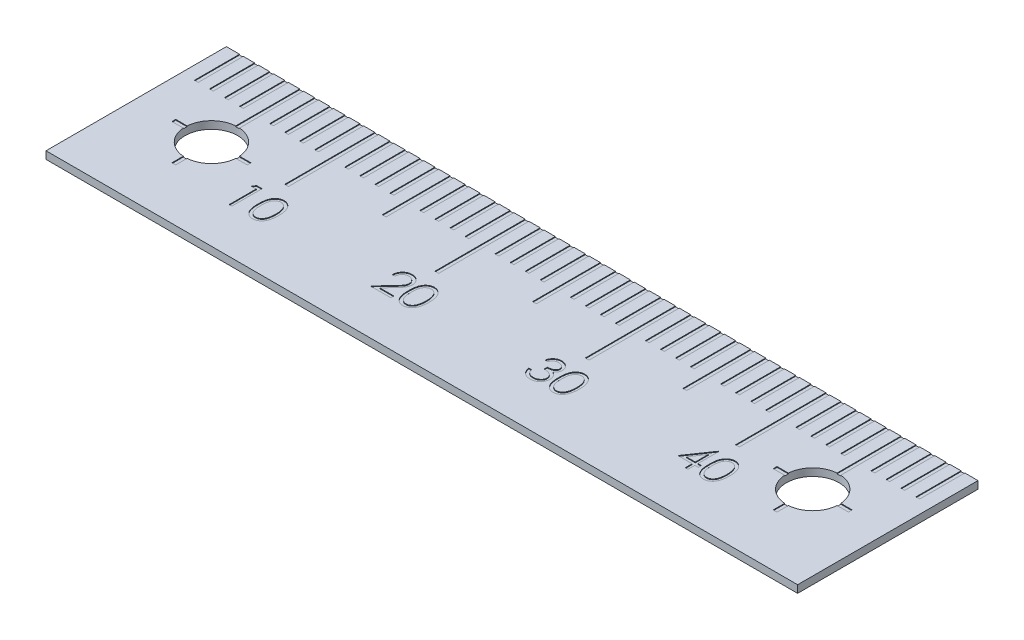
from build123d import *

# Parameters (mm, degrees)
SKETCH1_W           = 50
SKETCH1_H           = 12
BOSS_EXTRUDE1_DEPTH = 0.5
SKETCH2_W           = 0.25
SKETCH2_H           = 3
CUT_EXTRUDE2_DEPTH  = 0.05
LPATTERN2_COUNT     = 49
LPATTERN2_PITCH     = 1
SKETCH3_W           = 0.25
SKETCH3_H           = 3
CUT_EXTRUDE3_DEPTH  = 0.05
LPATTERN3_COUNT     = 4
LPATTERN3_PITCH     = 10
SKETCH4_W           = 0.25
SKETCH4_H           = 1.5
CUT_EXTRUDE4_DEPTH  = 0.05
LPATTERN4_COUNT     = 4
LPATTERN4_PITCH     = 10
LPATTERN4_COL_COUNT = 2
LPATTERN4_COL_PITCH = 10
CUT_EXTRUDE6_DEPTH  = 0.05
LPATTERN5_COUNT     = 2
LPATTERN5_PITCH     = 40
CUT_EXTRUDE7_DEPTH  = 0.05
SKETCH20_R          = 1.75
CUT_EXTRUDE15_DEPTH = 0.5
LPATTERN6_COUNT     = 2
LPATTERN6_PITCH     = 40


with BuildPart() as part:
    # Sketch1 → Boss-Extrude1 (new body)
    with BuildSketch(Plane(origin=(0, 0, 0), x_dir=(1, 0, 0), z_dir=(0, 1, 0))):
        Rectangle(SKETCH1_W, SKETCH1_H)
    extrude(amount=-BOSS_EXTRUDE1_DEPTH)

    # Sketch2 → Cut-Extrude2 (cut)
    with BuildSketch(Plane(origin=(0, 0, 0), x_dir=(1, 0, 0), z_dir=(0, 1, 0))):
        with Locations((-24, 4.5)):
            Rectangle(SKETCH2_W, SKETCH2_H)
    cut_extrude2 = extrude(amount=-CUT_EXTRUDE2_DEPTH, mode=Mode.SUBTRACT)

    # LPattern2: Cut-Extrude2 ×49
    with Locations(*[(i * LPATTERN2_PITCH, 0, 0) for i in range(1, LPATTERN2_COUNT)]):
        add(cut_extrude2, mode=Mode.SUBTRACT)

    # Sketch3 → Cut-Extrude3 (cut)
    with BuildSketch(Plane(origin=(0, 0, 0), x_dir=(1, 0, 0), z_dir=(0, 1, 0))):
        with Locations((-15, 1.5)):
            Rectangle(SKETCH3_W, SKETCH3_H)
    cut_extrude3 = extrude(amount=-CUT_EXTRUDE3_DEPTH, mode=Mode.SUBTRACT)

    # LPattern3: Cut-Extrude3 ×4
    with Locations(*[(i * LPATTERN3_PITCH, 0, 0) for i in range(1, LPATTERN3_COUNT)]):
        add(cut_extrude3, mode=Mode.SUBTRACT)

    # Sketch4 → Cut-Extrude4 (cut)
    with BuildSketch(Plane(origin=(0, 0, 0), x_dir=(1, 0, 0), z_dir=(0, 1, 0))):
        with Locations((-10, 2.25)):
            Rectangle(SKETCH4_W, SKETCH4_H)
    cut_extrude4 = extrude(amount=-CUT_EXTRUDE4_DEPTH, mode=Mode.SUBTRACT)

    # LPattern4: Cut-Extrude4 ×4
    with Locations(*[(i * LPATTERN4_PITCH, 0, 0) for i in range(1, LPATTERN4_COUNT)]):
        add(cut_extrude4, mode=Mode.SUBTRACT)

    # LPattern4 col: Cut-Extrude4 ×2
    with Locations(*[(-i * LPATTERN4_COL_PITCH, 0, 0) for i in range(1, LPATTERN4_COL_COUNT)]):
        add(cut_extrude4, mode=Mode.SUBTRACT)

    # Sketch5 → Cut-Extrude6 (cut)
    with BuildSketch(Plane(origin=(0, 0, 0), x_dir=(1, 0, 0), z_dir=(0, 1, 0))):
        with BuildLine():
            Line((-20.12, 2.5), (-19.87, 2.5))
            Line((-19.87, 2.5), (-19.87, 1.74553))
            ThreePointArc((-19.87, 1.74553), (-18.757563, 1.237437), (-18.24947, 0.125))
            Line((-18.24947, 0.125), (-17.495, 0.125))
            Line((-17.495, 0.125), (-17.495, -0.125))
            Line((-17.495, -0.125), (-18.24947, -0.125))
            ThreePointArc((-18.24947, -0.125), (-18.757563, -1.237437), (-19.87, -1.74553))
            Line((-19.87, -1.74553), (-19.87, -2.5))
            Line((-19.87, -2.5), (-20.12, -2.5))
            Line((-20.12, -2.5), (-20.12, -1.74553))
            ThreePointArc((-20.12, -1.74553), (-21.232437, -1.237437), (-21.74053, -0.125))
            Line((-21.74053, -0.125), (-22.495, -0.125))
            Line((-22.495, -0.125), (-22.495, 0.125))
            Line((-22.495, 0.125), (-21.74053, 0.125))
            ThreePointArc((-21.74053, 0.125), (-21.232437, 1.237437), (-20.12, 1.74553))
            Line((-20.12, 1.74553), (-20.12, 2.5))
        make_face()
        with BuildLine():
            Line((-20.12, 1.494783), (-20.12, 0.125))
            Line((-20.12, 0.125), (-21.489783, 0.125))
            ThreePointArc((-21.489783, 0.125), (-21.05566, 1.06066), (-20.12, 1.494783))
        make_face(mode=Mode.SUBTRACT)
        with BuildLine():
            Line((-19.87, 1.494783), (-19.87, 0.125))
            Line((-19.87, 0.125), (-18.500217, 0.125))
            ThreePointArc((-18.500217, 0.125), (-18.93434, 1.06066), (-19.87, 1.494783))
        make_face(mode=Mode.SUBTRACT)
        with BuildLine():
            Line((-21.489783, -0.125), (-20.12, -0.125))
            Line((-20.12, -0.125), (-20.12, -1.494783))
            ThreePointArc((-20.12, -1.494783), (-21.05566, -1.06066), (-21.489783, -0.125))
        make_face(mode=Mode.SUBTRACT)
        with BuildLine():
            Line((-19.87, -0.125), (-19.87, -1.494783))
            ThreePointArc((-19.87, -1.494783), (-18.93434, -1.06066), (-18.500217, -0.125))
            Line((-18.500217, -0.125), (-19.87, -0.125))
        make_face(mode=Mode.SUBTRACT)
    cut_extrude6 = extrude(amount=-CUT_EXTRUDE6_DEPTH, mode=Mode.SUBTRACT)

    # LPattern5: Cut-Extrude6 ×2
    with Locations(*[(i * LPATTERN5_PITCH, 0, 0) for i in range(1, LPATTERN5_COUNT)]):
        add(cut_extrude6, mode=Mode.SUBTRACT)

    # Sketch7 → Cut-Extrude7 (cut)
    # profile 1 of 8: a face of its own
    with BuildSketch(Plane(origin=(0, 0, 0), x_dir=(1, 0, 0), z_dir=(0, 1, 0))):
        Polygon((-15.997997, -1), (-15.628205, -1), (-15.628205, -3), (-15.807692, -3), (-15.807692, -1.205128), (-16.115385, -1.205128), align=None)
    # profile 2 of 8: a face of its own
    with BuildSketch(Plane(origin=(0, 0, 0), x_dir=(1, 0, 0), z_dir=(0, 1, 0))):
        with BuildLine():
            add(Edge.make_bspline(
                [(-14.884615, -2.000801), (-14.884428, -1.968746), (-14.884064, -1.906477), (-14.880013, -1.815743), (-14.873285, -1.730623), (-14.864063, -1.651112), (-14.852841, -1.577191), (-14.837861, -1.509057), (-14.820825, -1.446395), (-14.801081, -1.388999), (-14.778802, -1.336098), (-14.754554, -1.286712), (-14.727374, -1.240916), (-14.698816, -1.197981), (-14.667723, -1.158607), (-14.634981, -1.12224), (-14.599312, -1.089719), (-14.561927, -1.060093), (-14.522489, -1.034122), (-14.482122, -1.011246), (-14.440548, -0.991703), (-14.397653, -0.976337), (-14.353823, -0.963645), (-14.308904, -0.954966), (-14.262823, -0.949505), (-14.23172, -0.948983), (-14.215946, -0.948718)],
                knots=[0, 0, 0, 0, 1.646271, 3.197905, 4.663502, 6.030701, 7.308323, 8.501638, 9.611534, 10.641858, 11.616357, 12.558055, 13.465017, 14.349606, 15.204444, 16.039544, 16.859896, 17.680448, 18.487036, 19.282494, 20.061911, 20.843046, 21.620317, 22.403197, 23.190182, 24, 24, 24, 24], degree=3))
            add(Edge.make_bspline(
                [(-14.215946, -0.948718), (-14.20004, -0.948997), (-14.168408, -0.949551), (-14.121642, -0.954879), (-14.075956, -0.96372), (-14.031546, -0.976246), (-13.988046, -0.991786), (-13.945796, -1.011265), (-13.904535, -1.033938), (-13.864918, -1.060581), (-13.826509, -1.090285), (-13.790253, -1.123863), (-13.756147, -1.160977), (-13.723761, -1.20123), (-13.694015, -1.245393), (-13.665687, -1.292698), (-13.640332, -1.343973), (-13.615912, -1.398362), (-13.594833, -1.45737), (-13.575824, -1.520664), (-13.560465, -1.588992), (-13.547671, -1.661995), (-13.537759, -1.739942), (-13.530541, -1.822666), (-13.526728, -1.910221), (-13.52601, -1.970082), (-13.525641, -2.000801)],
                knots=[0, 0, 0, 0, 0.810915, 1.612654, 2.396698, 3.181599, 3.963628, 4.749916, 5.551656, 6.361999, 7.182127, 8.025566, 8.878628, 9.750805, 10.657532, 11.591945, 12.560507, 13.572878, 14.63071, 15.753379, 16.941252, 18.199788, 19.531963, 20.947069, 22.433334, 24, 24, 24, 24], degree=3))
            add(Edge.make_bspline(
                [(-13.525641, -2.000801), (-13.526013, -2.031386), (-13.526739, -2.09098), (-13.530498, -2.178141), (-13.537903, -2.260425), (-13.547166, -2.338031), (-13.559995, -2.410636), (-13.575769, -2.47849), (-13.593284, -2.541886), (-13.614904, -2.600306), (-13.638567, -2.654564), (-13.664313, -2.705231), (-13.691896, -2.752755), (-13.721946, -2.796755), (-13.753977, -2.837542), (-13.788673, -2.874398), (-13.825056, -2.90821), (-13.863577, -2.938297), (-13.903812, -2.964631), (-13.944932, -2.988182), (-13.987665, -3.007172), (-14.031044, -3.023477), (-14.075689, -3.035935), (-14.121544, -3.044549), (-14.168376, -3.05059), (-14.200034, -3.05105), (-14.215946, -3.051282)],
                knots=[0, 0, 0, 0, 1.561519, 3.042556, 4.452378, 5.778352, 7.031515, 8.214009, 9.334063, 10.386616, 11.391082, 12.354593, 13.286541, 14.194234, 15.072675, 15.931287, 16.775624, 17.606196, 18.423083, 19.229, 20.022332, 20.807537, 21.593274, 22.384846, 23.188221, 24, 24, 24, 24], degree=3))
            add(Edge.make_bspline(
                [(-14.215946, -3.051282), (-14.231719, -3.051016), (-14.262822, -3.05049), (-14.308909, -3.045054), (-14.353642, -3.036313), (-14.397241, -3.024075), (-14.439931, -3.009095), (-14.481129, -2.989579), (-14.521293, -2.967102), (-14.560317, -2.941505), (-14.597467, -2.912178), (-14.632951, -2.879742), (-14.66588, -2.843385), (-14.696528, -2.803684), (-14.725656, -2.761002), (-14.75245, -2.714757), (-14.777233, -2.665133), (-14.799887, -2.611808), (-14.819972, -2.554005), (-14.837713, -2.491063), (-14.851721, -2.422426), (-14.863712, -2.348644), (-14.873383, -2.269402), (-14.879985, -2.184656), (-14.884066, -2.094458), (-14.884429, -2.03259), (-14.884615, -2.000801)],
                knots=[0, 0, 0, 0, 0.810892, 1.59892, 2.382837, 3.152668, 3.926045, 4.706494, 5.493654, 6.291793, 7.103789, 7.925228, 8.761436, 9.622818, 10.502889, 11.416981, 12.369137, 13.353925, 14.394356, 15.51418, 16.714355, 17.994756, 19.357759, 20.818453, 22.365282, 24, 24, 24, 24], degree=3))
        make_face()
        with BuildLine():
            add(Edge.make_bspline(
                [(-14.705128, -2), (-14.70506, -2.026714), (-14.704927, -2.078559), (-14.701467, -2.153898), (-14.696752, -2.224167), (-14.690672, -2.289455), (-14.681641, -2.349541), (-14.671523, -2.404837), (-14.65921, -2.455053), (-14.644641, -2.500532), (-14.628048, -2.542046), (-14.60993, -2.580675), (-14.590467, -2.616876), (-14.568684, -2.650324), (-14.544961, -2.681127), (-14.519834, -2.709832), (-14.492364, -2.73543), (-14.454362, -2.766131), (-14.404192, -2.797856), (-14.340981, -2.825483), (-14.276027, -2.842844), (-14.231941, -2.845052), (-14.209936, -2.846154)],
                knots=[0, 0, 0, 0, 1.459021, 2.831674, 4.118529, 5.306027, 6.411945, 7.43633, 8.375795, 9.233975, 10.042672, 10.816086, 11.563611, 12.285937, 12.993565, 13.685989, 14.367179, 15.041617, 16.353049, 17.594442, 18.799311, 20, 20, 20, 20], degree=3))
            add(Edge.make_bspline(
                [(-14.209936, -2.846154), (-14.187789, -2.845241), (-14.14354, -2.843417), (-14.078892, -2.825817), (-14.016132, -2.799263), (-13.966948, -2.767865), (-13.929529, -2.737963), (-13.90272, -2.712469), (-13.878113, -2.683923), (-13.854774, -2.653123), (-13.833369, -2.619482), (-13.813905, -2.58316), (-13.796143, -2.544058), (-13.786023, -2.516761), (-13.780849, -2.502804)],
                knots=[0, 0, 0, 0, 1.353761, 2.704727, 4.075138, 5.516105, 6.260822, 7.00711, 7.77809, 8.566572, 9.372053, 10.217411, 11.088608, 12, 12, 12, 12], degree=3))
            add(Edge.make_bspline(
                [(-13.780849, -2.502804), (-13.77482, -2.484959), (-13.762577, -2.448725), (-13.746799, -2.392517), (-13.734373, -2.333544), (-13.723194, -2.272158), (-13.715564, -2.207907), (-13.709422, -2.140989), (-13.705805, -2.071354), (-13.705356, -2.024043), (-13.705128, -2)],
                knots=[0, 0, 0, 0, 0.884707, 1.796334, 2.740028, 3.714593, 4.726048, 5.77782, 6.870743, 8, 8, 8, 8], degree=3))
            add(Edge.make_bspline(
                [(-13.705128, -2), (-13.705443, -1.975961), (-13.706058, -1.928937), (-13.708408, -1.860069), (-13.714479, -1.794659), (-13.721221, -1.732424), (-13.731163, -1.67371), (-13.741881, -1.618024), (-13.756282, -1.566057), (-13.771665, -1.516994), (-13.789271, -1.471394), (-13.808651, -1.429043), (-13.829349, -1.389737), (-13.851831, -1.353585), (-13.875828, -1.320423), (-13.901975, -1.290918), (-13.929235, -1.264154), (-13.967416, -1.233604), (-14.017402, -1.202454), (-14.079599, -1.173788), (-14.144325, -1.157326), (-14.188081, -1.155005), (-14.209936, -1.153846)],
                knots=[0, 0, 0, 0, 1.313624, 2.569729, 3.763503, 4.902123, 5.988968, 7.016459, 7.998834, 8.933435, 9.825091, 10.667527, 11.477055, 12.250526, 12.991943, 13.710641, 14.402116, 15.076753, 16.378508, 17.609869, 18.806227, 20, 20, 20, 20], degree=3))
            add(Edge.make_bspline(
                [(-14.209936, -1.153846), (-14.232056, -1.155007), (-14.276337, -1.157331), (-14.341736, -1.173727), (-14.404424, -1.202306), (-14.454277, -1.233707), (-14.492485, -1.263615), (-14.51939, -1.28955), (-14.544616, -1.317919), (-14.567855, -1.349006), (-14.58962, -1.382415), (-14.609609, -1.418408), (-14.627619, -1.457169), (-14.644239, -1.498664), (-14.658852, -1.544139), (-14.670906, -1.594293), (-14.682041, -1.649414), (-14.689924, -1.709825), (-14.696932, -1.775129), (-14.701435, -1.845573), (-14.704939, -1.921039), (-14.705064, -1.973152), (-14.705128, -2)],
                knots=[0, 0, 0, 0, 1.207732, 2.417665, 3.655092, 4.956221, 5.625982, 6.301752, 6.994048, 7.697132, 8.419324, 9.170224, 9.943494, 10.752041, 11.61006, 12.549351, 13.567764, 14.679664, 15.874934, 17.154273, 18.533957, 20, 20, 20, 20], degree=3))
        make_face(mode=Mode.SUBTRACT)
    # profile 3 of 8: a face of its own
    with BuildSketch(Plane(origin=(0, 0, 0), x_dir=(1, 0, 0), z_dir=(0, 1, 0))):
        with BuildLine():
            Line((-6.166667, -1.615385), (-6.346154, -1.615385))
            add(Edge.make_bspline(
                [(-6.346154, -1.615385), (-6.344984, -1.591573), (-6.342687, -1.544807), (-6.331928, -1.476622), (-6.316533, -1.411447), (-6.294766, -1.349807), (-6.267734, -1.291157), (-6.235317, -1.235728), (-6.19692, -1.183733), (-6.153374, -1.135654), (-6.106077, -1.091547), (-6.055045, -1.053458), (-6.00142, -1.021276), (-5.945363, -0.994373), (-5.886243, -0.974179), (-5.824595, -0.959195), (-5.76015, -0.95018), (-5.716241, -0.949211), (-5.69391, -0.948718)],
                knots=[0, 0, 0, 0, 1.100653, 2.161653, 3.183659, 4.190469, 5.17592, 6.163126, 7.151508, 8.156236, 9.156009, 10.134483, 11.092019, 12.041331, 13.001268, 13.972401, 14.968799, 16, 16, 16, 16], degree=3))
            add(Edge.make_bspline(
                [(-5.69391, -0.948718), (-5.67198, -0.949231), (-5.628888, -0.95024), (-5.565995, -0.958904), (-5.506122, -0.972473), (-5.449386, -0.99151), (-5.39624, -1.017101), (-5.346284, -1.047842), (-5.298924, -1.083397), (-5.256291, -1.125256), (-5.217144, -1.169943), (-5.183371, -1.21765), (-5.154449, -1.266924), (-5.130342, -1.31814), (-5.112596, -1.371781), (-5.099122, -1.427065), (-5.091507, -1.484565), (-5.090338, -1.523483), (-5.089744, -1.543269)],
                knots=[0, 0, 0, 0, 1.111607, 2.184269, 3.212621, 4.221275, 5.21176, 6.196651, 7.192148, 8.207485, 9.220403, 10.201282, 11.166442, 12.114753, 13.065576, 14.026451, 14.996634, 16, 16, 16, 16], degree=3))
            add(Edge.make_bspline(
                [(-5.089744, -1.543269), (-5.090711, -1.571125), (-5.092629, -1.626348), (-5.109038, -1.707499), (-5.134664, -1.786124), (-5.16552, -1.849403), (-5.196647, -1.900393), (-5.224697, -1.942375), (-5.257534, -1.987579), (-5.295636, -2.035851), (-5.338215, -2.087572), (-5.385656, -2.142709), (-5.438298, -2.200693), (-5.475246, -2.240296), (-5.494391, -2.260817)],
                knots=[0, 0, 0, 0, 1.184426, 2.348068, 3.509069, 4.696111, 5.333549, 6.050745, 6.844228, 7.710549, 8.66745, 9.695053, 10.805634, 12, 12, 12, 12], degree=3))
            Line((-5.494391, -2.260817), (-5.994792, -2.794872))
            Line((-5.994792, -2.794872), (-5.064103, -2.794872))
            Line((-5.064103, -2.794872), (-5.064103, -3))
            Line((-5.064103, -3), (-6.423077, -3))
            Line((-6.423077, -3), (-5.647436, -2.172276))
            add(Edge.make_bspline(
                [(-5.647436, -2.172276), (-5.628551, -2.152562), (-5.592278, -2.114697), (-5.540974, -2.059415), (-5.494894, -2.00813), (-5.453742, -1.960938), (-5.418408, -1.917148), (-5.387053, -1.87818), (-5.361929, -1.84232), (-5.334663, -1.800754), (-5.308255, -1.750004), (-5.285563, -1.687985), (-5.271726, -1.624141), (-5.270066, -1.580997), (-5.269231, -1.559295)],
                knots=[0, 0, 0, 0, 1.329632, 2.55395, 3.673216, 4.687768, 5.603094, 6.413772, 7.123043, 7.734684, 8.834405, 9.900288, 10.943827, 12, 12, 12, 12], degree=3))
            add(Edge.make_bspline(
                [(-5.269231, -1.559295), (-5.269594, -1.545648), (-5.27031, -1.518754), (-5.276629, -1.479322), (-5.286178, -1.441285), (-5.299861, -1.404526), (-5.317922, -1.369414), (-5.339906, -1.335907), (-5.365272, -1.303513), (-5.394616, -1.27314), (-5.426851, -1.245322), (-5.460905, -1.220679), (-5.496933, -1.200086), (-5.534785, -1.183204), (-5.574354, -1.169961), (-5.615716, -1.160784), (-5.658759, -1.155023), (-5.688149, -1.154243), (-5.703125, -1.153846)],
                knots=[0, 0, 0, 0, 0.991446, 1.95395, 2.895816, 3.838931, 4.798493, 5.759822, 6.748412, 7.785213, 8.824557, 9.840281, 10.836138, 11.835679, 12.848802, 13.863922, 14.911576, 16, 16, 16, 16], degree=3))
            add(Edge.make_bspline(
                [(-5.703125, -1.153846), (-5.718765, -1.154255), (-5.749481, -1.155057), (-5.794577, -1.16067), (-5.837598, -1.170353), (-5.87865, -1.183597), (-5.917804, -1.200431), (-5.95487, -1.221397), (-5.989763, -1.246417), (-6.022549, -1.274783), (-6.052757, -1.306364), (-6.079298, -1.34157), (-6.102489, -1.379757), (-6.122723, -1.420822), (-6.139155, -1.465139), (-6.151711, -1.512549), (-6.161646, -1.562847), (-6.164965, -1.597581), (-6.166667, -1.615385)],
                knots=[0, 0, 0, 0, 1.031019, 2.024751, 2.990194, 3.934041, 4.864654, 5.795059, 6.735615, 7.690565, 8.649604, 9.611026, 10.590973, 11.59108, 12.624614, 13.70102, 14.821632, 16, 16, 16, 16], degree=3))
        make_face()
    # profile 4 of 8: a face of its own
    with BuildSketch(Plane(origin=(0, 0, 0), x_dir=(1, 0, 0), z_dir=(0, 1, 0))):
        with BuildLine():
            add(Edge.make_bspline(
                [(-4.884615, -2.000801), (-4.884428, -1.968746), (-4.884064, -1.906477), (-4.880013, -1.815743), (-4.873285, -1.730623), (-4.864063, -1.651112), (-4.852841, -1.577191), (-4.837861, -1.509057), (-4.820825, -1.446395), (-4.801081, -1.388999), (-4.778802, -1.336098), (-4.754554, -1.286712), (-4.727374, -1.240916), (-4.698816, -1.197981), (-4.667723, -1.158607), (-4.634981, -1.12224), (-4.599312, -1.089719), (-4.561927, -1.060093), (-4.522489, -1.034122), (-4.482122, -1.011246), (-4.440548, -0.991703), (-4.397653, -0.976337), (-4.353823, -0.963645), (-4.308904, -0.954966), (-4.262823, -0.949505), (-4.23172, -0.948983), (-4.215946, -0.948718)],
                knots=[0, 0, 0, 0, 1.646271, 3.197905, 4.663502, 6.030701, 7.308323, 8.501638, 9.611534, 10.641858, 11.616357, 12.558055, 13.465017, 14.349606, 15.204444, 16.039544, 16.859896, 17.680448, 18.487036, 19.282494, 20.061911, 20.843046, 21.620317, 22.403197, 23.190182, 24, 24, 24, 24], degree=3))
            add(Edge.make_bspline(
                [(-4.215946, -0.948718), (-4.20004, -0.948997), (-4.168408, -0.949551), (-4.121642, -0.954879), (-4.075956, -0.96372), (-4.031546, -0.976246), (-3.988046, -0.991786), (-3.945796, -1.011265), (-3.904535, -1.033938), (-3.864918, -1.060581), (-3.826509, -1.090285), (-3.790253, -1.123863), (-3.756147, -1.160977), (-3.723761, -1.20123), (-3.694015, -1.245393), (-3.665687, -1.292698), (-3.640332, -1.343973), (-3.615912, -1.398362), (-3.594833, -1.45737), (-3.575824, -1.520664), (-3.560465, -1.588992), (-3.547671, -1.661995), (-3.537759, -1.739942), (-3.530541, -1.822666), (-3.526728, -1.910221), (-3.52601, -1.970082), (-3.525641, -2.000801)],
                knots=[0, 0, 0, 0, 0.810915, 1.612654, 2.396698, 3.181599, 3.963628, 4.749916, 5.551656, 6.361999, 7.182127, 8.025566, 8.878628, 9.750805, 10.657532, 11.591945, 12.560507, 13.572878, 14.63071, 15.753379, 16.941252, 18.199788, 19.531963, 20.947069, 22.433334, 24, 24, 24, 24], degree=3))
            add(Edge.make_bspline(
                [(-3.525641, -2.000801), (-3.526013, -2.031386), (-3.526739, -2.09098), (-3.530498, -2.178141), (-3.537903, -2.260425), (-3.547166, -2.338031), (-3.559995, -2.410636), (-3.575769, -2.47849), (-3.593284, -2.541886), (-3.614904, -2.600306), (-3.638567, -2.654564), (-3.664313, -2.705231), (-3.691896, -2.752755), (-3.721946, -2.796755), (-3.753977, -2.837542), (-3.788673, -2.874398), (-3.825056, -2.90821), (-3.863577, -2.938297), (-3.903812, -2.964631), (-3.944932, -2.988182), (-3.987665, -3.007172), (-4.031044, -3.023477), (-4.075689, -3.035935), (-4.121544, -3.044549), (-4.168376, -3.05059), (-4.200034, -3.05105), (-4.215946, -3.051282)],
                knots=[0, 0, 0, 0, 1.561519, 3.042556, 4.452378, 5.778352, 7.031515, 8.214009, 9.334063, 10.386616, 11.391082, 12.354593, 13.286541, 14.194234, 15.072675, 15.931287, 16.775624, 17.606196, 18.423083, 19.229, 20.022332, 20.807537, 21.593274, 22.384846, 23.188221, 24, 24, 24, 24], degree=3))
            add(Edge.make_bspline(
                [(-4.215946, -3.051282), (-4.231719, -3.051016), (-4.262822, -3.05049), (-4.308909, -3.045054), (-4.353642, -3.036313), (-4.397241, -3.024075), (-4.439931, -3.009095), (-4.481129, -2.989579), (-4.521293, -2.967102), (-4.560317, -2.941505), (-4.597467, -2.912178), (-4.632951, -2.879742), (-4.66588, -2.843385), (-4.696528, -2.803684), (-4.725656, -2.761002), (-4.75245, -2.714757), (-4.777233, -2.665133), (-4.799887, -2.611808), (-4.819972, -2.554005), (-4.837713, -2.491063), (-4.851721, -2.422426), (-4.863712, -2.348644), (-4.873383, -2.269402), (-4.879985, -2.184656), (-4.884066, -2.094458), (-4.884429, -2.03259), (-4.884615, -2.000801)],
                knots=[0, 0, 0, 0, 0.810892, 1.59892, 2.382837, 3.152668, 3.926045, 4.706494, 5.493654, 6.291793, 7.103789, 7.925228, 8.761436, 9.622818, 10.502889, 11.416981, 12.369137, 13.353925, 14.394356, 15.51418, 16.714355, 17.994756, 19.357759, 20.818453, 22.365282, 24, 24, 24, 24], degree=3))
        make_face()
        with BuildLine():
            add(Edge.make_bspline(
                [(-4.705128, -2), (-4.70506, -2.026714), (-4.704927, -2.078559), (-4.701467, -2.153898), (-4.696752, -2.224167), (-4.690672, -2.289455), (-4.681641, -2.349541), (-4.671523, -2.404837), (-4.65921, -2.455053), (-4.644641, -2.500532), (-4.628048, -2.542046), (-4.60993, -2.580675), (-4.590467, -2.616876), (-4.568684, -2.650324), (-4.544961, -2.681127), (-4.519834, -2.709832), (-4.492364, -2.73543), (-4.454362, -2.766131), (-4.404192, -2.797856), (-4.340981, -2.825483), (-4.276027, -2.842844), (-4.231941, -2.845052), (-4.209936, -2.846154)],
                knots=[0, 0, 0, 0, 1.459021, 2.831674, 4.118529, 5.306027, 6.411945, 7.43633, 8.375795, 9.233975, 10.042672, 10.816086, 11.563611, 12.285937, 12.993565, 13.685989, 14.367179, 15.041617, 16.353049, 17.594442, 18.799311, 20, 20, 20, 20], degree=3))
            add(Edge.make_bspline(
                [(-4.209936, -2.846154), (-4.187789, -2.845241), (-4.14354, -2.843417), (-4.078892, -2.825817), (-4.016132, -2.799263), (-3.966948, -2.767865), (-3.929529, -2.737963), (-3.90272, -2.712469), (-3.878113, -2.683923), (-3.854774, -2.653123), (-3.833369, -2.619482), (-3.813905, -2.58316), (-3.796143, -2.544058), (-3.786023, -2.516761), (-3.780849, -2.502804)],
                knots=[0, 0, 0, 0, 1.353761, 2.704727, 4.075138, 5.516105, 6.260822, 7.00711, 7.77809, 8.566572, 9.372053, 10.217411, 11.088608, 12, 12, 12, 12], degree=3))
            add(Edge.make_bspline(
                [(-3.780849, -2.502804), (-3.77482, -2.484959), (-3.762577, -2.448725), (-3.746799, -2.392517), (-3.734373, -2.333544), (-3.723194, -2.272158), (-3.715564, -2.207907), (-3.709422, -2.140989), (-3.705805, -2.071354), (-3.705356, -2.024043), (-3.705128, -2)],
                knots=[0, 0, 0, 0, 0.884707, 1.796334, 2.740028, 3.714593, 4.726048, 5.77782, 6.870743, 8, 8, 8, 8], degree=3))
            add(Edge.make_bspline(
                [(-3.705128, -2), (-3.705443, -1.975961), (-3.706058, -1.928937), (-3.708408, -1.860069), (-3.714479, -1.794659), (-3.721221, -1.732424), (-3.731163, -1.67371), (-3.741881, -1.618024), (-3.756282, -1.566057), (-3.771665, -1.516994), (-3.789271, -1.471394), (-3.808651, -1.429043), (-3.829349, -1.389737), (-3.851831, -1.353585), (-3.875828, -1.320423), (-3.901975, -1.290918), (-3.929235, -1.264154), (-3.967416, -1.233604), (-4.017402, -1.202454), (-4.079599, -1.173788), (-4.144325, -1.157326), (-4.188081, -1.155005), (-4.209936, -1.153846)],
                knots=[0, 0, 0, 0, 1.313624, 2.569729, 3.763503, 4.902123, 5.988968, 7.016459, 7.998834, 8.933435, 9.825091, 10.667527, 11.477055, 12.250526, 12.991943, 13.710641, 14.402116, 15.076753, 16.378508, 17.609869, 18.806227, 20, 20, 20, 20], degree=3))
            add(Edge.make_bspline(
                [(-4.209936, -1.153846), (-4.232056, -1.155007), (-4.276337, -1.157331), (-4.341736, -1.173727), (-4.404424, -1.202306), (-4.454277, -1.233707), (-4.492485, -1.263615), (-4.51939, -1.28955), (-4.544616, -1.317919), (-4.567855, -1.349006), (-4.58962, -1.382415), (-4.609609, -1.418408), (-4.627619, -1.457169), (-4.644239, -1.498664), (-4.658852, -1.544139), (-4.670906, -1.594293), (-4.682041, -1.649414), (-4.689924, -1.709825), (-4.696932, -1.775129), (-4.701435, -1.845573), (-4.704939, -1.921039), (-4.705064, -1.973152), (-4.705128, -2)],
                knots=[0, 0, 0, 0, 1.207732, 2.417665, 3.655092, 4.956221, 5.625982, 6.301752, 6.994048, 7.697132, 8.419324, 9.170224, 9.943494, 10.752041, 11.61006, 12.549351, 13.567764, 14.679664, 15.874934, 17.154273, 18.533957, 20, 20, 20, 20], degree=3))
        make_face(mode=Mode.SUBTRACT)
    # profile 5 of 8: a face of its own
    with BuildSketch(Plane(origin=(0, 0, 0), x_dir=(1, 0, 0), z_dir=(0, 1, 0))):
        with BuildLine():
            Line((3.833333, -1.461538), (3.653846, -1.461538))
            add(Edge.make_bspline(
                [(3.653846, -1.461538), (3.658709, -1.441406), (3.668215, -1.402048), (3.688042, -1.345815), (3.709641, -1.292601), (3.735578, -1.243404), (3.763869, -1.197233), (3.796282, -1.155136), (3.831322, -1.116043), (3.870079, -1.08135), (3.910724, -1.049934), (3.953829, -1.023148), (3.998528, -1.000106), (4.04513, -0.981123), (4.093773, -0.966823), (4.144019, -0.956447), (4.195998, -0.949709), (4.231282, -0.949052), (4.249199, -0.948718)],
                knots=[0, 0, 0, 0, 1.162006, 2.271626, 3.343759, 4.38331, 5.39023, 6.379919, 7.361854, 8.333199, 9.295911, 10.242431, 11.177959, 12.116337, 13.062827, 14.020065, 14.994645, 16, 16, 16, 16], degree=3))
            add(Edge.make_bspline(
                [(4.249199, -0.948718), (4.275303, -0.949506), (4.326943, -0.951065), (4.402807, -0.965302), (4.475965, -0.987831), (4.545616, -1.018958), (4.610313, -1.057351), (4.667876, -1.103045), (4.717527, -1.155159), (4.759181, -1.212721), (4.791795, -1.274238), (4.815844, -1.337553), (4.830485, -1.402514), (4.832383, -1.446375), (4.833333, -1.468349)],
                knots=[0, 0, 0, 0, 1.083051, 2.142477, 3.193116, 4.255572, 5.302634, 6.308963, 7.297364, 8.282367, 9.249858, 10.179914, 11.088141, 12, 12, 12, 12], degree=3))
            add(Edge.make_bspline(
                [(4.833333, -1.468349), (4.832668, -1.489496), (4.831367, -1.530877), (4.820319, -1.591289), (4.801727, -1.648227), (4.775973, -1.701931), (4.742635, -1.752059), (4.702251, -1.798726), (4.654535, -1.842137), (4.618376, -1.867005), (4.59976, -1.879808)],
                knots=[0, 0, 0, 0, 1.02454, 2.004867, 2.965041, 3.920578, 4.882998, 5.874505, 6.905732, 8, 8, 8, 8], degree=3))
            add(Edge.make_bspline(
                [(4.59976, -1.879808), (4.621035, -1.890081), (4.663187, -1.910435), (4.720645, -1.950353), (4.772804, -1.996442), (4.801891, -2.032409), (4.816506, -2.050481)],
                knots=[0, 0, 0, 0, 1.015518, 2.012036, 3.001164, 4, 4, 4, 4], degree=3))
            add(Edge.make_bspline(
                [(4.816506, -2.050481), (4.82613, -2.063657), (4.84522, -2.089793), (4.868783, -2.131813), (4.890159, -2.1743), (4.906817, -2.218391), (4.919716, -2.263576), (4.928937, -2.309931), (4.934665, -2.357496), (4.935485, -2.389674), (4.935897, -2.405849)],
                knots=[0, 0, 0, 0, 1.025084, 2.033382, 3.024893, 4.013698, 4.99189, 5.976765, 6.982997, 8, 8, 8, 8], degree=3))
            add(Edge.make_bspline(
                [(4.935897, -2.405849), (4.934872, -2.433855), (4.932826, -2.489734), (4.914538, -2.572291), (4.886187, -2.652992), (4.845926, -2.730177), (4.796859, -2.802394), (4.738484, -2.86701), (4.671463, -2.922552), (4.596717, -2.968957), (4.515736, -3.006053), (4.429121, -3.0318), (4.338121, -3.04857), (4.275717, -3.050368), (4.24399, -3.051282)],
                knots=[0, 0, 0, 0, 0.955779, 1.90706, 2.875434, 3.871313, 4.872416, 5.851225, 6.836216, 7.836434, 8.849229, 9.869734, 10.916972, 12, 12, 12, 12], degree=3))
            add(Edge.make_bspline(
                [(4.24399, -3.051282), (4.222608, -3.050786), (4.180534, -3.04981), (4.118681, -3.043136), (4.05964, -3.030948), (4.003332, -3.014546), (3.949706, -2.99375), (3.898926, -2.967854), (3.850681, -2.93739), (3.805424, -2.902), (3.763162, -2.86241), (3.725018, -2.81792), (3.690355, -2.76935), (3.660102, -2.716136), (3.632881, -2.658968), (3.610492, -2.597111), (3.590786, -2.531121), (3.581624, -2.485133), (3.576923, -2.461538)],
                knots=[0, 0, 0, 0, 1.048659, 2.063411, 3.046034, 4.001478, 4.936775, 5.862367, 6.792675, 7.73072, 8.675894, 9.62783, 10.600096, 11.597688, 12.626045, 13.701542, 14.820724, 16, 16, 16, 16], degree=3))
            Line((3.576923, -2.461538), (3.75641, -2.461538))
            add(Edge.make_bspline(
                [(3.75641, -2.461538), (3.761086, -2.476938), (3.770182, -2.506891), (3.785664, -2.55), (3.803303, -2.589519), (3.822226, -2.625738), (3.842099, -2.659013), (3.864337, -2.688466), (3.88729, -2.715389), (3.904593, -2.730557), (3.913061, -2.737981)],
                knots=[0, 0, 0, 0, 1.198163, 2.330531, 3.407731, 4.417277, 5.372219, 6.288973, 7.162601, 8, 8, 8, 8], degree=3))
            add(Edge.make_bspline(
                [(3.913061, -2.737981), (3.924259, -2.746614), (3.94662, -2.763854), (3.983059, -2.785855), (4.021382, -2.804918), (4.062419, -2.819481), (4.105285, -2.831811), (4.150672, -2.83988), (4.19818, -2.845416), (4.230619, -2.845904), (4.247196, -2.846154)],
                knots=[0, 0, 0, 0, 0.94617, 1.88942, 2.845303, 3.807233, 4.801019, 5.828865, 6.890508, 8, 8, 8, 8], degree=3))
            add(Edge.make_bspline(
                [(4.247196, -2.846154), (4.265912, -2.845802), (4.30251, -2.845114), (4.355913, -2.838785), (4.406717, -2.829567), (4.454359, -2.815331), (4.499462, -2.797742), (4.541394, -2.775657), (4.580706, -2.749746), (4.616894, -2.720295), (4.649435, -2.688054), (4.678086, -2.654333), (4.702443, -2.619272), (4.722091, -2.582679), (4.737605, -2.544705), (4.748167, -2.505242), (4.755511, -2.464615), (4.756109, -2.436999), (4.75641, -2.423077)],
                knots=[0, 0, 0, 0, 1.217148, 2.380027, 3.494445, 4.572153, 5.609568, 6.639425, 7.649109, 8.668171, 9.669598, 10.6252, 11.543418, 12.441394, 13.322311, 14.205496, 15.095365, 16, 16, 16, 16], degree=3))
            add(Edge.make_bspline(
                [(4.75641, -2.423077), (4.755536, -2.404442), (4.753791, -2.367264), (4.740472, -2.312569), (4.718564, -2.25987), (4.687894, -2.210066), (4.650559, -2.163909), (4.606922, -2.122725), (4.55662, -2.088742), (4.510323, -2.065263), (4.469315, -2.049242), (4.43422, -2.03857), (4.394931, -2.029534), (4.351921, -2.021127), (4.304868, -2.013972), (4.253822, -2.008005), (4.198773, -2.003231), (4.160664, -2.001099), (4.141026, -2)],
                knots=[0, 0, 0, 0, 1.070547, 2.135767, 3.216562, 4.339749, 5.48608, 6.621378, 7.775626, 8.963673, 9.598147, 10.304877, 11.070271, 11.915, 12.823868, 13.805723, 14.869254, 16, 16, 16, 16], degree=3))
            Line((4.141026, -2), (4.141026, -1.794872))
            add(Edge.make_bspline(
                [(4.141026, -1.794872), (4.165769, -1.794452), (4.214236, -1.793629), (4.285032, -1.783682), (4.352731, -1.769922), (4.415832, -1.748844), (4.473346, -1.724364), (4.523243, -1.695877), (4.564824, -1.664212), (4.597888, -1.628879), (4.622761, -1.590984), (4.640948, -1.551489), (4.651691, -1.510047), (4.653125, -1.481764), (4.653846, -1.467548)],
                knots=[0, 0, 0, 0, 1.321987, 2.589447, 3.816329, 5.010887, 6.139806, 7.153945, 8.075214, 8.924035, 9.728124, 10.488708, 11.240356, 12, 12, 12, 12], degree=3))
            add(Edge.make_bspline(
                [(4.653846, -1.467548), (4.653609, -1.457104), (4.653138, -1.436325), (4.647197, -1.405968), (4.638269, -1.376539), (4.625995, -1.348163), (4.609566, -1.321037), (4.589906, -1.29493), (4.566495, -1.26999), (4.539669, -1.246745), (4.510862, -1.224591), (4.479291, -1.205783), (4.445907, -1.1897), (4.410674, -1.176437), (4.373476, -1.166461), (4.33449, -1.159297), (4.29364, -1.154819), (4.26577, -1.154174), (4.251603, -1.153846)],
                knots=[0, 0, 0, 0, 0.884393, 1.759458, 2.611959, 3.489219, 4.372814, 5.294549, 6.255912, 7.266815, 8.301785, 9.332969, 10.376267, 11.440494, 12.520033, 13.637163, 14.798856, 16, 16, 16, 16], degree=3))
            add(Edge.make_bspline(
                [(4.251603, -1.153846), (4.22883, -1.154641), (4.18435, -1.156194), (4.120228, -1.169796), (4.060617, -1.191498), (4.015052, -1.217402), (3.981404, -1.242974), (3.95736, -1.265307), (3.933749, -1.290125), (3.912123, -1.318959), (3.890252, -1.349854), (3.870341, -1.384382), (3.850992, -1.421642), (3.839334, -1.447982), (3.833333, -1.461538)],
                knots=[0, 0, 0, 0, 1.472543, 2.87622, 4.22179, 5.565194, 6.249814, 6.953379, 7.68725, 8.46357, 9.283607, 10.136033, 11.040678, 12, 12, 12, 12], degree=3))
        make_face()
    # profile 6 of 8: a face of its own
    with BuildSketch(Plane(origin=(0, 0, 0), x_dir=(1, 0, 0), z_dir=(0, 1, 0))):
        with BuildLine():
            add(Edge.make_bspline(
                [(5.115385, -2.000801), (5.115572, -1.968746), (5.115936, -1.906477), (5.119987, -1.815743), (5.126715, -1.730623), (5.135937, -1.651112), (5.147159, -1.577191), (5.162139, -1.509057), (5.179175, -1.446395), (5.198919, -1.388999), (5.221198, -1.336098), (5.245446, -1.286712), (5.272626, -1.240916), (5.301184, -1.197981), (5.332277, -1.158607), (5.365019, -1.12224), (5.400688, -1.089719), (5.438073, -1.060093), (5.477511, -1.034122), (5.517878, -1.011246), (5.559452, -0.991703), (5.602347, -0.976337), (5.646177, -0.963645), (5.691096, -0.954966), (5.737177, -0.949505), (5.76828, -0.948983), (5.784054, -0.948718)],
                knots=[0, 0, 0, 0, 1.646271, 3.197905, 4.663502, 6.030701, 7.308323, 8.501638, 9.611534, 10.641858, 11.616357, 12.558055, 13.465017, 14.349606, 15.204444, 16.039544, 16.859896, 17.680448, 18.487036, 19.282494, 20.061911, 20.843046, 21.620317, 22.403197, 23.190182, 24, 24, 24, 24], degree=3))
            add(Edge.make_bspline(
                [(5.784054, -0.948718), (5.79996, -0.948997), (5.831592, -0.949551), (5.878358, -0.954879), (5.924044, -0.96372), (5.968454, -0.976246), (6.011954, -0.991786), (6.054204, -1.011265), (6.095465, -1.033938), (6.135082, -1.060581), (6.173491, -1.090285), (6.209747, -1.123863), (6.243853, -1.160977), (6.276239, -1.20123), (6.305985, -1.245393), (6.334313, -1.292698), (6.359668, -1.343973), (6.384088, -1.398362), (6.405167, -1.45737), (6.424176, -1.520664), (6.439535, -1.588992), (6.452329, -1.661995), (6.462241, -1.739942), (6.469459, -1.822666), (6.473272, -1.910221), (6.47399, -1.970082), (6.474359, -2.000801)],
                knots=[0, 0, 0, 0, 0.810915, 1.612654, 2.396698, 3.181599, 3.963628, 4.749916, 5.551656, 6.361999, 7.182127, 8.025566, 8.878628, 9.750805, 10.657532, 11.591945, 12.560507, 13.572878, 14.63071, 15.753379, 16.941252, 18.199788, 19.531963, 20.947069, 22.433334, 24, 24, 24, 24], degree=3))
            add(Edge.make_bspline(
                [(6.474359, -2.000801), (6.473987, -2.031386), (6.473261, -2.09098), (6.469502, -2.178141), (6.462097, -2.260425), (6.452834, -2.338031), (6.440005, -2.410636), (6.424231, -2.47849), (6.406716, -2.541886), (6.385096, -2.600306), (6.361433, -2.654564), (6.335687, -2.705231), (6.308104, -2.752755), (6.278054, -2.796755), (6.246023, -2.837542), (6.211327, -2.874398), (6.174944, -2.90821), (6.136423, -2.938297), (6.096188, -2.964631), (6.055068, -2.988182), (6.012335, -3.007172), (5.968956, -3.023477), (5.924311, -3.035935), (5.878456, -3.044549), (5.831624, -3.05059), (5.799966, -3.05105), (5.784054, -3.051282)],
                knots=[0, 0, 0, 0, 1.561519, 3.042556, 4.452378, 5.778352, 7.031515, 8.214009, 9.334063, 10.386616, 11.391082, 12.354593, 13.286541, 14.194234, 15.072675, 15.931287, 16.775624, 17.606196, 18.423083, 19.229, 20.022332, 20.807537, 21.593274, 22.384846, 23.188221, 24, 24, 24, 24], degree=3))
            add(Edge.make_bspline(
                [(5.784054, -3.051282), (5.768281, -3.051016), (5.737178, -3.05049), (5.691091, -3.045054), (5.646358, -3.036313), (5.602759, -3.024075), (5.560069, -3.009095), (5.518871, -2.989579), (5.478707, -2.967102), (5.439683, -2.941505), (5.402533, -2.912178), (5.367049, -2.879742), (5.33412, -2.843385), (5.303472, -2.803684), (5.274344, -2.761002), (5.24755, -2.714757), (5.222767, -2.665133), (5.200113, -2.611808), (5.180028, -2.554005), (5.162287, -2.491063), (5.148279, -2.422426), (5.136288, -2.348644), (5.126617, -2.269402), (5.120015, -2.184656), (5.115934, -2.094458), (5.115571, -2.03259), (5.115385, -2.000801)],
                knots=[0, 0, 0, 0, 0.810892, 1.59892, 2.382837, 3.152668, 3.926045, 4.706494, 5.493654, 6.291793, 7.103789, 7.925228, 8.761436, 9.622818, 10.502889, 11.416981, 12.369137, 13.353925, 14.394356, 15.51418, 16.714355, 17.994756, 19.357759, 20.818453, 22.365282, 24, 24, 24, 24], degree=3))
        make_face()
        with BuildLine():
            add(Edge.make_bspline(
                [(5.294872, -2), (5.29494, -2.026714), (5.295073, -2.078559), (5.298533, -2.153898), (5.303248, -2.224167), (5.309328, -2.289455), (5.318359, -2.349541), (5.328477, -2.404837), (5.34079, -2.455053), (5.355359, -2.500532), (5.371952, -2.542046), (5.39007, -2.580675), (5.409533, -2.616876), (5.431316, -2.650324), (5.455039, -2.681127), (5.480166, -2.709832), (5.507636, -2.73543), (5.545638, -2.766131), (5.595808, -2.797856), (5.659019, -2.825483), (5.723973, -2.842844), (5.768059, -2.845052), (5.790064, -2.846154)],
                knots=[0, 0, 0, 0, 1.459021, 2.831674, 4.118529, 5.306027, 6.411945, 7.43633, 8.375795, 9.233975, 10.042672, 10.816086, 11.563611, 12.285937, 12.993565, 13.685989, 14.367179, 15.041617, 16.353049, 17.594442, 18.799311, 20, 20, 20, 20], degree=3))
            add(Edge.make_bspline(
                [(5.790064, -2.846154), (5.812211, -2.845241), (5.85646, -2.843417), (5.921108, -2.825817), (5.983868, -2.799263), (6.033052, -2.767865), (6.070471, -2.737963), (6.09728, -2.712469), (6.121887, -2.683923), (6.145226, -2.653123), (6.166631, -2.619482), (6.186095, -2.58316), (6.203857, -2.544058), (6.213977, -2.516761), (6.219151, -2.502804)],
                knots=[0, 0, 0, 0, 1.353761, 2.704727, 4.075138, 5.516105, 6.260822, 7.00711, 7.77809, 8.566572, 9.372053, 10.217411, 11.088608, 12, 12, 12, 12], degree=3))
            add(Edge.make_bspline(
                [(6.219151, -2.502804), (6.22518, -2.484959), (6.237423, -2.448725), (6.253201, -2.392517), (6.265627, -2.333544), (6.276806, -2.272158), (6.284436, -2.207907), (6.290578, -2.140989), (6.294195, -2.071354), (6.294644, -2.024043), (6.294872, -2)],
                knots=[0, 0, 0, 0, 0.884707, 1.796334, 2.740028, 3.714593, 4.726048, 5.77782, 6.870743, 8, 8, 8, 8], degree=3))
            add(Edge.make_bspline(
                [(6.294872, -2), (6.294557, -1.975961), (6.293942, -1.928937), (6.291592, -1.860069), (6.285521, -1.794659), (6.278779, -1.732424), (6.268837, -1.67371), (6.258119, -1.618024), (6.243718, -1.566057), (6.228335, -1.516994), (6.210729, -1.471394), (6.191349, -1.429043), (6.170651, -1.389737), (6.148169, -1.353585), (6.124172, -1.320423), (6.098025, -1.290918), (6.070765, -1.264154), (6.032584, -1.233604), (5.982598, -1.202454), (5.920401, -1.173788), (5.855675, -1.157326), (5.811919, -1.155005), (5.790064, -1.153846)],
                knots=[0, 0, 0, 0, 1.313624, 2.569729, 3.763503, 4.902123, 5.988968, 7.016459, 7.998834, 8.933435, 9.825091, 10.667527, 11.477055, 12.250526, 12.991943, 13.710641, 14.402116, 15.076753, 16.378508, 17.609869, 18.806227, 20, 20, 20, 20], degree=3))
            add(Edge.make_bspline(
                [(5.790064, -1.153846), (5.767944, -1.155007), (5.723663, -1.157331), (5.658264, -1.173727), (5.595576, -1.202306), (5.545723, -1.233707), (5.507515, -1.263615), (5.48061, -1.28955), (5.455384, -1.317919), (5.432145, -1.349006), (5.41038, -1.382415), (5.390391, -1.418408), (5.372381, -1.457169), (5.355761, -1.498664), (5.341148, -1.544139), (5.329094, -1.594293), (5.317959, -1.649414), (5.310076, -1.709825), (5.303068, -1.775129), (5.298565, -1.845573), (5.295061, -1.921039), (5.294936, -1.973152), (5.294872, -2)],
                knots=[0, 0, 0, 0, 1.207732, 2.417665, 3.655092, 4.956221, 5.625982, 6.301752, 6.994048, 7.697132, 8.419324, 9.170224, 9.943494, 10.752041, 11.61006, 12.549351, 13.567764, 14.679664, 15.874934, 17.154273, 18.533957, 20, 20, 20, 20], degree=3))
        make_face(mode=Mode.SUBTRACT)
    # profile 7 of 8: a face of its own
    with BuildSketch(Plane(origin=(0, 0, 0), x_dir=(1, 0, 0), z_dir=(0, 1, 0))):
        Polygon((14.66867, -0.948718), (14.705128, -0.948718), (14.705128, -2.333333), (14.935897, -2.333333), (14.935897, -2.538462), (14.705128, -2.538462), (14.705128, -3), (14.525641, -3), (14.525641, -2.538462), (13.576923, -2.538462), align=None)
        Polygon((14.525641, -2.333333), (14.525641, -1.464744), (13.929487, -2.333333), align=None, mode=Mode.SUBTRACT)
    # profile 8 of 8: a face of its own
    with BuildSketch(Plane(origin=(0, 0, 0), x_dir=(1, 0, 0), z_dir=(0, 1, 0))):
        with BuildLine():
            add(Edge.make_bspline(
                [(15.115385, -2.000801), (15.115572, -1.968746), (15.115936, -1.906477), (15.119987, -1.815743), (15.126715, -1.730623), (15.135937, -1.651112), (15.147159, -1.577191), (15.162139, -1.509057), (15.179175, -1.446395), (15.198919, -1.388999), (15.221198, -1.336098), (15.245446, -1.286712), (15.272626, -1.240916), (15.301184, -1.197981), (15.332277, -1.158607), (15.365019, -1.12224), (15.400688, -1.089719), (15.438073, -1.060093), (15.477511, -1.034122), (15.517878, -1.011246), (15.559452, -0.991703), (15.602347, -0.976337), (15.646177, -0.963645), (15.691096, -0.954966), (15.737177, -0.949505), (15.76828, -0.948983), (15.784054, -0.948718)],
                knots=[0, 0, 0, 0, 1.646271, 3.197905, 4.663502, 6.030701, 7.308323, 8.501638, 9.611534, 10.641858, 11.616357, 12.558055, 13.465017, 14.349606, 15.204444, 16.039544, 16.859896, 17.680448, 18.487036, 19.282494, 20.061911, 20.843046, 21.620317, 22.403197, 23.190182, 24, 24, 24, 24], degree=3))
            add(Edge.make_bspline(
                [(15.784054, -0.948718), (15.79996, -0.948997), (15.831592, -0.949551), (15.878358, -0.954879), (15.924044, -0.96372), (15.968454, -0.976246), (16.011954, -0.991786), (16.054204, -1.011265), (16.095465, -1.033938), (16.135082, -1.060581), (16.173491, -1.090285), (16.209747, -1.123863), (16.243853, -1.160977), (16.276239, -1.20123), (16.305985, -1.245393), (16.334313, -1.292698), (16.359668, -1.343973), (16.384088, -1.398362), (16.405167, -1.45737), (16.424176, -1.520664), (16.439535, -1.588992), (16.452329, -1.661995), (16.462241, -1.739942), (16.469459, -1.822666), (16.473272, -1.910221), (16.47399, -1.970082), (16.474359, -2.000801)],
                knots=[0, 0, 0, 0, 0.810915, 1.612654, 2.396698, 3.181599, 3.963628, 4.749916, 5.551656, 6.361999, 7.182127, 8.025566, 8.878628, 9.750805, 10.657532, 11.591945, 12.560507, 13.572878, 14.63071, 15.753379, 16.941252, 18.199788, 19.531963, 20.947069, 22.433334, 24, 24, 24, 24], degree=3))
            add(Edge.make_bspline(
                [(16.474359, -2.000801), (16.473987, -2.031386), (16.473261, -2.09098), (16.469502, -2.178141), (16.462097, -2.260425), (16.452834, -2.338031), (16.440005, -2.410636), (16.424231, -2.47849), (16.406716, -2.541886), (16.385096, -2.600306), (16.361433, -2.654564), (16.335687, -2.705231), (16.308104, -2.752755), (16.278054, -2.796755), (16.246023, -2.837542), (16.211327, -2.874398), (16.174944, -2.90821), (16.136423, -2.938297), (16.096188, -2.964631), (16.055068, -2.988182), (16.012335, -3.007172), (15.968956, -3.023477), (15.924311, -3.035935), (15.878456, -3.044549), (15.831624, -3.05059), (15.799966, -3.05105), (15.784054, -3.051282)],
                knots=[0, 0, 0, 0, 1.561519, 3.042556, 4.452378, 5.778352, 7.031515, 8.214009, 9.334063, 10.386616, 11.391082, 12.354593, 13.286541, 14.194234, 15.072675, 15.931287, 16.775624, 17.606196, 18.423083, 19.229, 20.022332, 20.807537, 21.593274, 22.384846, 23.188221, 24, 24, 24, 24], degree=3))
            add(Edge.make_bspline(
                [(15.784054, -3.051282), (15.768281, -3.051016), (15.737178, -3.05049), (15.691091, -3.045054), (15.646358, -3.036313), (15.602759, -3.024075), (15.560069, -3.009095), (15.518871, -2.989579), (15.478707, -2.967102), (15.439683, -2.941505), (15.402533, -2.912178), (15.367049, -2.879742), (15.33412, -2.843385), (15.303472, -2.803684), (15.274344, -2.761002), (15.24755, -2.714757), (15.222767, -2.665133), (15.200113, -2.611808), (15.180028, -2.554005), (15.162287, -2.491063), (15.148279, -2.422426), (15.136288, -2.348644), (15.126617, -2.269402), (15.120015, -2.184656), (15.115934, -2.094458), (15.115571, -2.03259), (15.115385, -2.000801)],
                knots=[0, 0, 0, 0, 0.810892, 1.59892, 2.382837, 3.152668, 3.926045, 4.706494, 5.493654, 6.291793, 7.103789, 7.925228, 8.761436, 9.622818, 10.502889, 11.416981, 12.369137, 13.353925, 14.394356, 15.51418, 16.714355, 17.994756, 19.357759, 20.818453, 22.365282, 24, 24, 24, 24], degree=3))
        make_face()
        with BuildLine():
            add(Edge.make_bspline(
                [(15.294872, -2), (15.29494, -2.026714), (15.295073, -2.078559), (15.298533, -2.153898), (15.303248, -2.224167), (15.309328, -2.289455), (15.318359, -2.349541), (15.328477, -2.404837), (15.34079, -2.455053), (15.355359, -2.500532), (15.371952, -2.542046), (15.39007, -2.580675), (15.409533, -2.616876), (15.431316, -2.650324), (15.455039, -2.681127), (15.480166, -2.709832), (15.507636, -2.73543), (15.545638, -2.766131), (15.595808, -2.797856), (15.659019, -2.825483), (15.723973, -2.842844), (15.768059, -2.845052), (15.790064, -2.846154)],
                knots=[0, 0, 0, 0, 1.459021, 2.831674, 4.118529, 5.306027, 6.411945, 7.43633, 8.375795, 9.233975, 10.042672, 10.816086, 11.563611, 12.285937, 12.993565, 13.685989, 14.367179, 15.041617, 16.353049, 17.594442, 18.799311, 20, 20, 20, 20], degree=3))
            add(Edge.make_bspline(
                [(15.790064, -2.846154), (15.812211, -2.845241), (15.85646, -2.843417), (15.921108, -2.825817), (15.983868, -2.799263), (16.033052, -2.767865), (16.070471, -2.737963), (16.09728, -2.712469), (16.121887, -2.683923), (16.145226, -2.653123), (16.166631, -2.619482), (16.186095, -2.58316), (16.203857, -2.544058), (16.213977, -2.516761), (16.219151, -2.502804)],
                knots=[0, 0, 0, 0, 1.353761, 2.704727, 4.075138, 5.516105, 6.260822, 7.00711, 7.77809, 8.566572, 9.372053, 10.217411, 11.088608, 12, 12, 12, 12], degree=3))
            add(Edge.make_bspline(
                [(16.219151, -2.502804), (16.22518, -2.484959), (16.237423, -2.448725), (16.253201, -2.392517), (16.265627, -2.333544), (16.276806, -2.272158), (16.284436, -2.207907), (16.290578, -2.140989), (16.294195, -2.071354), (16.294644, -2.024043), (16.294872, -2)],
                knots=[0, 0, 0, 0, 0.884707, 1.796334, 2.740028, 3.714593, 4.726048, 5.77782, 6.870743, 8, 8, 8, 8], degree=3))
            add(Edge.make_bspline(
                [(16.294872, -2), (16.294557, -1.975961), (16.293942, -1.928937), (16.291592, -1.860069), (16.285521, -1.794659), (16.278779, -1.732424), (16.268837, -1.67371), (16.258119, -1.618024), (16.243718, -1.566057), (16.228335, -1.516994), (16.210729, -1.471394), (16.191349, -1.429043), (16.170651, -1.389737), (16.148169, -1.353585), (16.124172, -1.320423), (16.098025, -1.290918), (16.070765, -1.264154), (16.032584, -1.233604), (15.982598, -1.202454), (15.920401, -1.173788), (15.855675, -1.157326), (15.811919, -1.155005), (15.790064, -1.153846)],
                knots=[0, 0, 0, 0, 1.313624, 2.569729, 3.763503, 4.902123, 5.988968, 7.016459, 7.998834, 8.933435, 9.825091, 10.667527, 11.477055, 12.250526, 12.991943, 13.710641, 14.402116, 15.076753, 16.378508, 17.609869, 18.806227, 20, 20, 20, 20], degree=3))
            add(Edge.make_bspline(
                [(15.790064, -1.153846), (15.767944, -1.155007), (15.723663, -1.157331), (15.658264, -1.173727), (15.595576, -1.202306), (15.545723, -1.233707), (15.507515, -1.263615), (15.48061, -1.28955), (15.455384, -1.317919), (15.432145, -1.349006), (15.41038, -1.382415), (15.390391, -1.418408), (15.372381, -1.457169), (15.355761, -1.498664), (15.341148, -1.544139), (15.329094, -1.594293), (15.317959, -1.649414), (15.310076, -1.709825), (15.303068, -1.775129), (15.298565, -1.845573), (15.295061, -1.921039), (15.294936, -1.973152), (15.294872, -2)],
                knots=[0, 0, 0, 0, 1.207732, 2.417665, 3.655092, 4.956221, 5.625982, 6.301752, 6.994048, 7.697132, 8.419324, 9.170224, 9.943494, 10.752041, 11.61006, 12.549351, 13.567764, 14.679664, 15.874934, 17.154273, 18.533957, 20, 20, 20, 20], degree=3))
        make_face(mode=Mode.SUBTRACT)
    extrude(amount=-CUT_EXTRUDE7_DEPTH, mode=Mode.SUBTRACT)

    # Sketch20 → Cut-Extrude15 (cut)
    with BuildSketch(Plane(origin=(0, 0, 0), x_dir=(1, 0, 0), z_dir=(0, 1, 0))):
        with Locations(Location((-19.995, 0, 0), (0, 0, 270))):
            Circle(SKETCH20_R)
    cut_extrude15 = extrude(amount=-CUT_EXTRUDE15_DEPTH, mode=Mode.SUBTRACT)

    # LPattern6: Cut-Extrude15 ×2
    with Locations(*[(i * LPATTERN6_PITCH, 0, 0) for i in range(1, LPATTERN6_COUNT)]):
        add(cut_extrude15, mode=Mode.SUBTRACT)


solid = part.part
